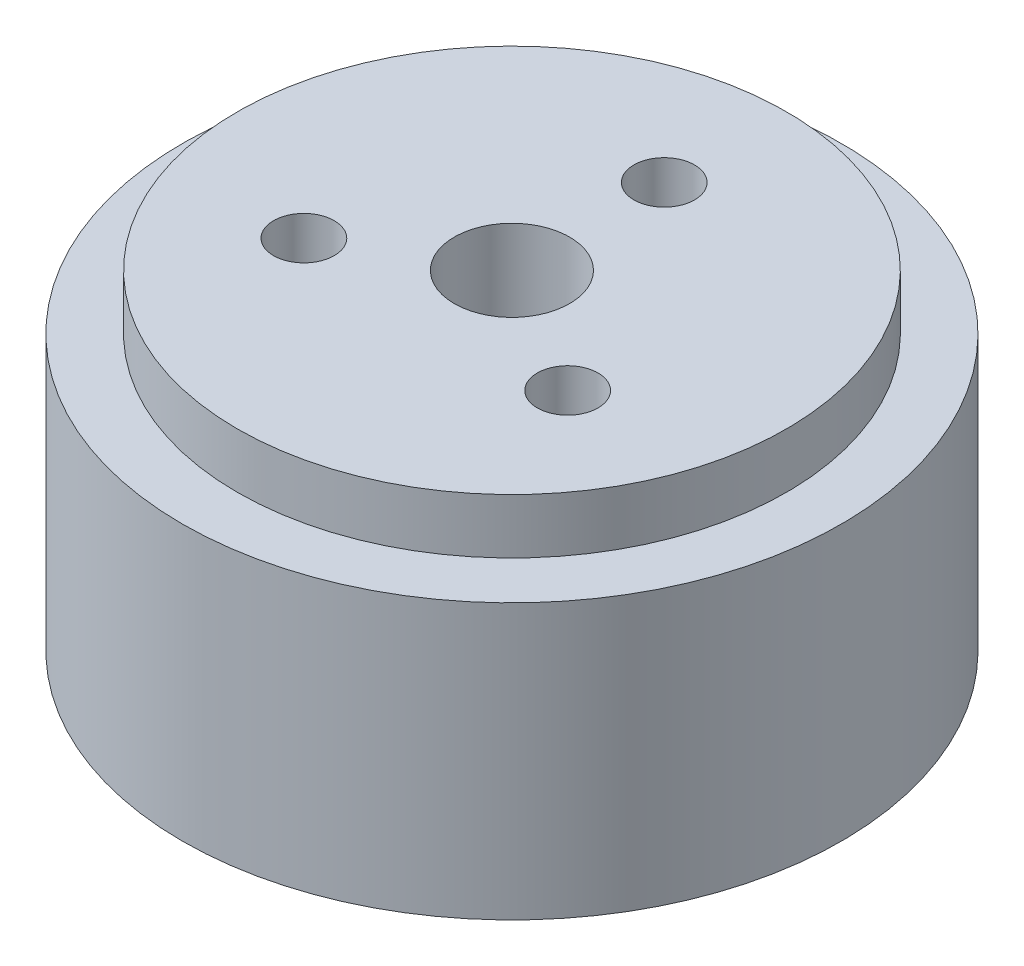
from build123d import *

# Parameters (mm, degrees)
SKETCH3_R           = 12
BOSS_EXTRUDE1_DEPTH = 10
SKETCH4_R           = 10
BOSS_EXTRUDE2_DEPTH = 2
SKETCH6_R           = 1.104657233
CUT_EXTRUDE1_DEPTH  = 4
SKETCH7_R           = 2.1
CUT_EXTRUDE2_DEPTH  = 20


with BuildPart() as part:
    # Sketch3 → Boss-Extrude1 (new body)
    with BuildSketch(Plane(origin=(0, 0, 0), x_dir=(1, 0, 0), z_dir=(0, 1, 0))):
        with Locations(Location((0, 0, 0), (0, 0, 270))):
            Circle(SKETCH3_R)
    extrude(amount=BOSS_EXTRUDE1_DEPTH)

    # Sketch4 → Boss-Extrude2 (add)
    with BuildSketch(Plane(origin=(0, 10, 0), x_dir=(1, 0, 0), z_dir=(0, 1, 0))):
        with Locations(Location((0, 0, 0), (0, 0, 270))):
            Circle(SKETCH4_R)
    extrude(amount=BOSS_EXTRUDE2_DEPTH)

    # Sketch6 → Cut-Extrude1 (cut)
    with BuildSketch(Plane(origin=(0, 12, 0), x_dir=(1, 0, 0), z_dir=(0, 1, 0))):
        with Locations(Location((0, 5.545255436, 0), (0, 0, 270))):
            Circle(SKETCH6_R)
        with Locations(Location((4.802332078, -2.772627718, 0), (0, 0, 270))):
            Circle(SKETCH6_R)
        with Locations(Location((-4.802332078, -2.772627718, 0), (0, 0, 270))):
            Circle(SKETCH6_R)
    extrude(amount=-CUT_EXTRUDE1_DEPTH, mode=Mode.SUBTRACT)

    # Sketch7 → Cut-Extrude2 (cut)
    with BuildSketch(Plane(origin=(0, 12, 0), x_dir=(1, 0, 0), z_dir=(0, 1, 0))):
        with Locations(Location((0, 0, 0), (0, 0, 270))):
            Circle(SKETCH7_R)
    extrude(amount=-CUT_EXTRUDE2_DEPTH, mode=Mode.SUBTRACT)


solid = part.part
